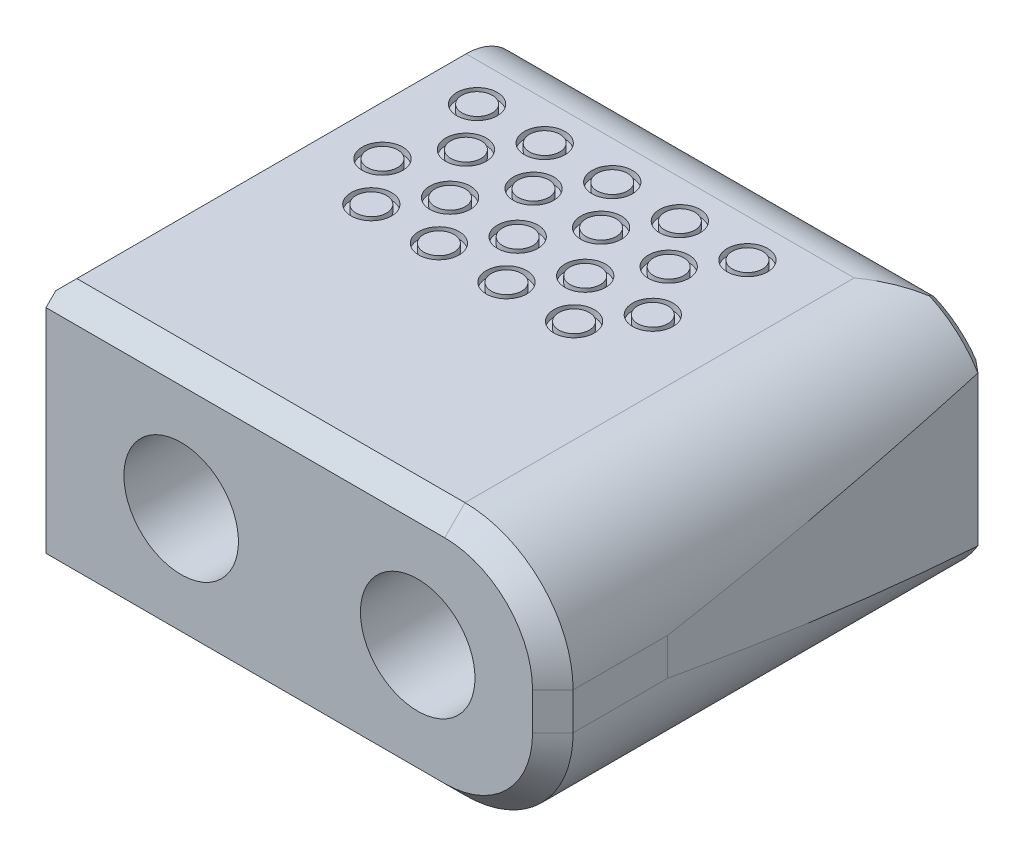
from build123d import *

# Parameters (mm, degrees)
SKETCH3_W             = 16.9672
SKETCH3_H             = 9.525
EXTRUDE1_DEPTH        = 19.05
F_6_CBORE_D           = 4.3053
F_6_CBORE_CBORE_D     = 6.604
F_6_CBORE_CBORE_DEPTH = 4.064
FILLET1_R             = 4.064
CHAMFER1_SIZE         = 0.396875
CHAMFER2_SIZE         = 0.762
CUT_EXTRUDE2_DEPTH    = 26.951296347
CUT_EXTRUDE1_DEPTH    = 12.5
CHAMFER3_SIZE         = 0.396875
CHAMFER3_SIZE2        = 0.443224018
CHAMFER4_SIZE         = 0.396875
SKETCH10_R            = 0.762
SKETCH10_R_2          = 0.5715
CUT_EXTRUDE3_DEPTH    = 0.254


with BuildPart() as part:
    # Sketch3 → Extrude1 (new body)
    with BuildSketch(Plane(origin=(0, 0, 0), x_dir=(0, 0, -1), z_dir=(1, 0, 0))):
        with Locations((8.4836, 0)):
            Rectangle(SKETCH3_W, SKETCH3_H)
    extrude(amount=EXTRUDE1_DEPTH)

    # 6 CBORE (through all)
    with Locations(Plane(origin=(0, 0, -16.9672), x_dir=(-1, 0, 0), z_dir=(0, 0, -1))):
        with Locations((-5.08, 0), (-13.97, 0)):
            CounterBoreHole(F_6_CBORE_D / 2, F_6_CBORE_CBORE_D / 2, F_6_CBORE_CBORE_DEPTH)

    # Fillet1
    fillet1_edges = [part.edges().sort_by_distance(p)[0] for p in [
        (19.05, 4.7625, -8.4836),
        (19.05, -4.7625, -8.4836),
    ]]
    fillet(fillet1_edges, radius=FILLET1_R)

    # Chamfer1
    chamfer1_edges = [part.edges().sort_by_distance(p)[0] for p in [
        (19.05, 0, -16.9672),
        (7.493, 4.7625, -16.9672),
        (7.493, -4.7625, -16.9672),
        (17.859681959, 3.572181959, -16.9672),
        (17.859681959, -3.572181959, -16.9672),
    ]]
    chamfer(chamfer1_edges, length=CHAMFER1_SIZE)

    # Chamfer2
    chamfer2_edges = [part.edges().sort_by_distance(p)[0] for p in [
        (19.05, 0, 0),
        (7.493, -4.7625, 0),
        (7.493, 4.7625, 0),
        (17.859681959, 3.572181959, 0),
        (17.859681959, -3.572181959, 0),
    ]]
    chamfer(chamfer2_edges, length=CHAMFER2_SIZE)

    # Sketch8 → Cut-Extrude2 (cut, through all)
    with BuildSketch(Plane.ZY):
        with BuildLine():
            Line((-15.3924, -4.7625), (-15.3924, -7.3025))
            Line((-15.3924, -7.3025), (-21.7424, -7.3025))
            Line((-21.7424, -7.3025), (-21.7424, -0.9525))
            Line((-21.7424, -0.9525), (-19.2024, -0.9525))
            ThreePointArc((-19.2024, -0.9525), (-18.770316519, -2.714822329), (-17.572069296, -4.077422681))
            Line((-17.572069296, -4.077422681), (-16.9672, -4.077422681))
            ThreePointArc((-16.9672, -4.077422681), (-16.251080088, -4.583814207), (-15.3924, -4.7625))
        make_face()
        with BuildLine():
            Line((-16.9672, 4.077422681), (-17.572069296, 4.077422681))
            ThreePointArc((-17.572069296, 4.077422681), (-18.770316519, 2.714822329), (-19.2024, 0.9525))
            Line((-19.2024, 0.9525), (-21.7424, 0.9525))
            Line((-21.7424, 0.9525), (-21.7424, 7.3025))
            Line((-21.7424, 7.3025), (-15.3924, 7.3025))
            Line((-15.3924, 7.3025), (-15.3924, 4.7625))
            ThreePointArc((-15.3924, 4.7625), (-16.251080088, 4.583814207), (-16.9672, 4.077422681))
        make_face()
    extrude(amount=-CUT_EXTRUDE2_DEPTH, mode=Mode.SUBTRACT)

    # Sketch5 → Cut-Extrude1 (cut, symmetric)
    with BuildSketch(Plane(origin=(0, 0, 0), x_dir=(1, 0, 0), z_dir=(0, 1, 0))):
        with BuildLine():
            Line((19.05, 4.318), (31.75, 4.318))
            Line((31.75, 4.318), (31.75, 29.718))
            Line((31.75, 29.718), (16.484078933, 29.718))
            ThreePointArc((16.484078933, 29.718), (18.406891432, 17.082638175), (19.05, 4.318))
        make_face()
    extrude(amount=CUT_EXTRUDE1_DEPTH, both=True, mode=Mode.SUBTRACT)

    # Chamfer3
    chamfer3_edges = [part.edges().sort_by_distance(p)[0] for p in [
        (18.418499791, 0, -16.9672),
    ]]
    chamfer3_side = [part.faces().sort_by_distance(p)[0] for p in [
        (18.892026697, 0, -10.650476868),
    ]]
    chamfer(chamfer3_edges, length=CHAMFER3_SIZE, length2=CHAMFER3_SIZE2, reference=chamfer3_side[0])

    # Chamfer4
    chamfer4_edges = [part.edges().sort_by_distance(p)[0] for p in [
        (0, 4.7625, -8.0772),
        (0, 4.583814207, -16.251080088),
        (0, -4.7625, -8.0772),
        (0, 0, -16.9672),
        (0, -4.583814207, -16.251080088),
    ]]
    chamfer(chamfer4_edges, length=CHAMFER4_SIZE)

    # Sketch10 → Cut-Extrude3 (cut)
    # profile 1 of 18: a face of its own
    with BuildSketch(Plane.XZ.offset(4.7625)):
        with Locations(Location((2.239852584, -13.963950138, 0), (0, 0, 270))):
            Circle(SKETCH10_R)
        with Locations(Location((2.239852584, -13.963950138, 0), (0, 0, 270))):
            Circle(SKETCH10_R_2, mode=Mode.SUBTRACT)
    # profile 2 of 18: a face of its own
    with BuildSketch(Plane.XZ.offset(4.7625)):
        with Locations(Location((4.779852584, -13.963950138, 0), (0, 0, 270))):
            Circle(SKETCH10_R)
        with Locations(Location((4.779852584, -13.963950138, 0), (0, 0, 270))):
            Circle(SKETCH10_R_2, mode=Mode.SUBTRACT)
    # profile 3 of 18: a face of its own
    with BuildSketch(Plane.XZ.offset(4.7625)):
        with Locations(Location((7.319852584, -13.963950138, 0), (0, 0, 270))):
            Circle(SKETCH10_R)
        with Locations(Location((7.319852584, -13.963950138, 0), (0, 0, 270))):
            Circle(SKETCH10_R_2, mode=Mode.SUBTRACT)
    # profile 4 of 18: a face of its own
    with BuildSketch(Plane.XZ.offset(4.7625)):
        with Locations(Location((9.859852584, -13.963950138, 0), (0, 0, 270))):
            Circle(SKETCH10_R)
        with Locations(Location((9.859852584, -13.963950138, 0), (0, 0, 270))):
            Circle(SKETCH10_R_2, mode=Mode.SUBTRACT)
    # profile 5 of 18: a face of its own
    with BuildSketch(Plane.XZ.offset(4.7625)):
        with Locations(Location((12.399852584, -13.963950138, 0), (0, 0, 270))):
            Circle(SKETCH10_R)
        with Locations(Location((12.399852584, -13.963950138, 0), (0, 0, 270))):
            Circle(SKETCH10_R_2, mode=Mode.SUBTRACT)
    # profile 6 of 18: a face of its own
    with BuildSketch(Plane.XZ.offset(4.7625)):
        with Locations(Location((3.512769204, -12.271327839, 0), (0, 0, 270))):
            Circle(SKETCH10_R)
        with Locations(Location((3.512769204, -12.271327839, 0), (0, 0, 270))):
            Circle(SKETCH10_R_2, mode=Mode.SUBTRACT)
    # profile 7 of 18: a face of its own
    with BuildSketch(Plane.XZ.offset(4.7625)):
        with Locations(Location((6.052769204, -12.271327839, 0), (0, 0, 270))):
            Circle(SKETCH10_R)
        with Locations(Location((6.052769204, -12.271327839, 0), (0, 0, 270))):
            Circle(SKETCH10_R_2, mode=Mode.SUBTRACT)
    # profile 8 of 18: a face of its own
    with BuildSketch(Plane.XZ.offset(4.7625)):
        with Locations(Location((8.592769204, -12.271327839, 0), (0, 0, 270))):
            Circle(SKETCH10_R)
        with Locations(Location((8.592769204, -12.271327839, 0), (0, 0, 270))):
            Circle(SKETCH10_R_2, mode=Mode.SUBTRACT)
    # profile 9 of 18: a face of its own
    with BuildSketch(Plane.XZ.offset(4.7625)):
        with Locations(Location((11.132769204, -12.271327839, 0), (0, 0, 270))):
            Circle(SKETCH10_R)
        with Locations(Location((11.132769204, -12.271327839, 0), (0, 0, 270))):
            Circle(SKETCH10_R_2, mode=Mode.SUBTRACT)
    # profile 10 of 18: a face of its own
    with BuildSketch(Plane.XZ.offset(4.7625)):
        with Locations(Location((2.239852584, -10.407950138, 0), (0, 0, 270))):
            Circle(SKETCH10_R)
        with Locations(Location((2.239852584, -10.407950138, 0), (0, 0, 270))):
            Circle(SKETCH10_R_2, mode=Mode.SUBTRACT)
    # profile 11 of 18: a face of its own
    with BuildSketch(Plane.XZ.offset(4.7625)):
        with Locations(Location((4.779852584, -10.407950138, 0), (0, 0, 270))):
            Circle(SKETCH10_R)
        with Locations(Location((4.779852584, -10.407950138, 0), (0, 0, 270))):
            Circle(SKETCH10_R_2, mode=Mode.SUBTRACT)
    # profile 12 of 18: a face of its own
    with BuildSketch(Plane.XZ.offset(4.7625)):
        with Locations(Location((7.319852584, -10.407950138, 0), (0, 0, 270))):
            Circle(SKETCH10_R)
        with Locations(Location((7.319852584, -10.407950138, 0), (0, 0, 270))):
            Circle(SKETCH10_R_2, mode=Mode.SUBTRACT)
    # profile 13 of 18: a face of its own
    with BuildSketch(Plane.XZ.offset(4.7625)):
        with Locations(Location((9.859852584, -10.407950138, 0), (0, 0, 270))):
            Circle(SKETCH10_R)
        with Locations(Location((9.859852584, -10.407950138, 0), (0, 0, 270))):
            Circle(SKETCH10_R_2, mode=Mode.SUBTRACT)
    # profile 14 of 18: a face of its own
    with BuildSketch(Plane.XZ.offset(4.7625)):
        with Locations(Location((12.399852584, -10.407950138, 0), (0, 0, 270))):
            Circle(SKETCH10_R)
        with Locations(Location((12.399852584, -10.407950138, 0), (0, 0, 270))):
            Circle(SKETCH10_R_2, mode=Mode.SUBTRACT)
    # profile 15 of 18: a face of its own
    with BuildSketch(Plane.XZ.offset(4.7625)):
        with Locations(Location((3.512769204, -8.715327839, 0), (0, 0, 270))):
            Circle(SKETCH10_R)
        with Locations(Location((3.512769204, -8.715327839, 0), (0, 0, 270))):
            Circle(SKETCH10_R_2, mode=Mode.SUBTRACT)
    # profile 16 of 18: a face of its own
    with BuildSketch(Plane.XZ.offset(4.7625)):
        with Locations(Location((6.052769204, -8.715327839, 0), (0, 0, 270))):
            Circle(SKETCH10_R)
        with Locations(Location((6.052769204, -8.715327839, 0), (0, 0, 270))):
            Circle(SKETCH10_R_2, mode=Mode.SUBTRACT)
    # profile 17 of 18: a face of its own
    with BuildSketch(Plane.XZ.offset(4.7625)):
        with Locations(Location((8.592769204, -8.715327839, 0), (0, 0, 270))):
            Circle(SKETCH10_R)
        with Locations(Location((8.592769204, -8.715327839, 0), (0, 0, 270))):
            Circle(SKETCH10_R_2, mode=Mode.SUBTRACT)
    # profile 18 of 18: a face of its own
    with BuildSketch(Plane.XZ.offset(4.7625)):
        with Locations(Location((11.132769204, -8.715327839, 0), (0, 0, 270))):
            Circle(SKETCH10_R)
        with Locations(Location((11.132769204, -8.715327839, 0), (0, 0, 270))):
            Circle(SKETCH10_R_2, mode=Mode.SUBTRACT)
    cut_extrude3 = extrude(amount=-CUT_EXTRUDE3_DEPTH, mode=Mode.SUBTRACT)

    # Mirror1: Cut-Extrude3 across plane
    add(cut_extrude3.mirror(Plane.ZX), mode=Mode.SUBTRACT)


solid = part.part
